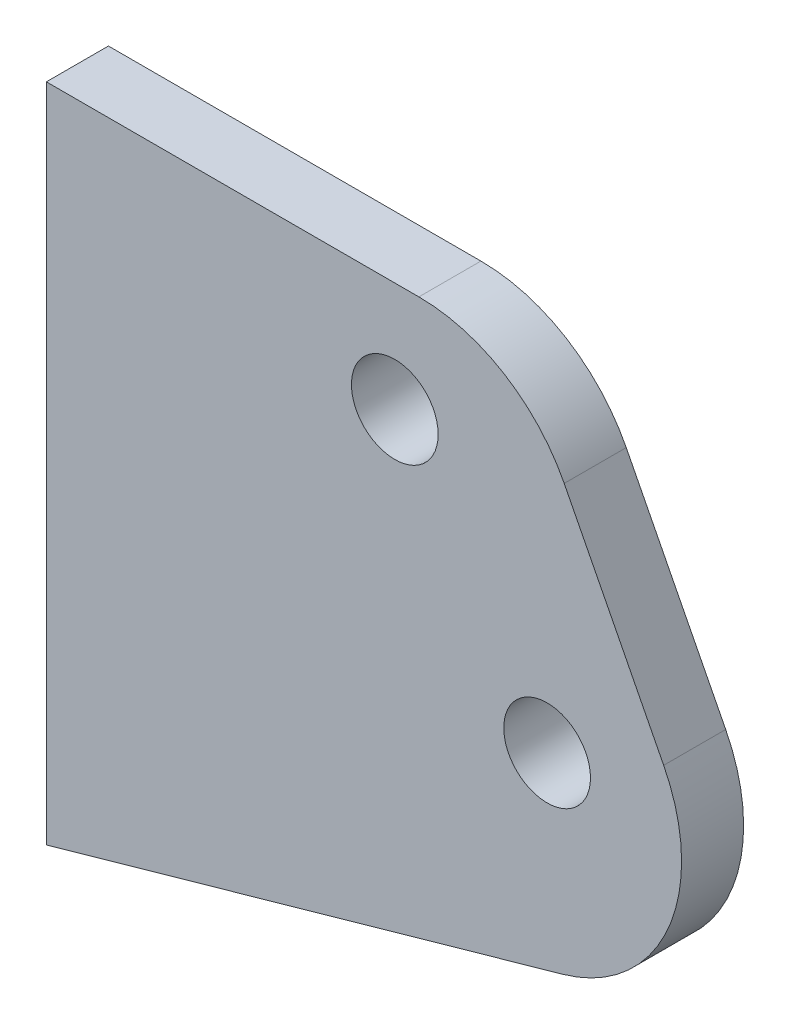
from build123d import *

# Parameters (mm, degrees)
BOSS_EXTRUDE1_DEPTH = 4.826
SKETCH2_R           = 3.37312
CUT_EXTRUDE1_DEPTH  = 76.503825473
FILLET1_R           = 12.7


with BuildPart() as part:
    # Sketch1 → Boss-Extrude1 (new body)
    with BuildSketch(Plane.XY):
        Polygon((0, 0), (0, 51.418008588), (36.748474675, 51.418008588), (55.079268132, 15.592353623), align=None)
    extrude(amount=BOSS_EXTRUDE1_DEPTH)

    # Sketch2 → Cut-Extrude1 (cut, through all)
    with BuildSketch(Plane.XY.offset(4.826)):
        with Locations((27.106233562, 42.897700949)):
            Circle(SKETCH2_R)
        with Locations((38.957723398, 25.683246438)):
            Circle(SKETCH2_R)
    extrude(amount=-CUT_EXTRUDE1_DEPTH, mode=Mode.SUBTRACT)

    # Fillet1
    fillet1_edges = [part.edges().sort_by_distance(p)[0] for p in [
        (36.748474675, 51.418008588, 2.413),
        (55.079268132, 15.592353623, 2.413),
    ]]
    fillet(fillet1_edges, radius=FILLET1_R)


solid = part.part
